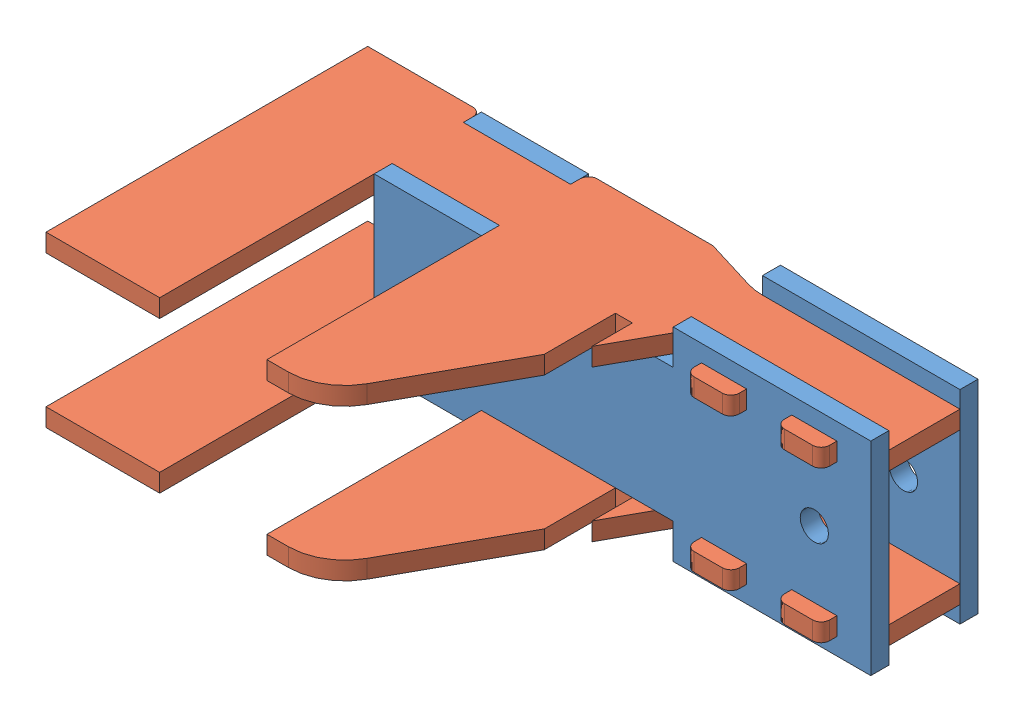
SolidWorks assembly Assemblage_encast.SLDASM, configuration Défaut (file format 12000). Lengths in mm.
Overall size (108.14 36 59.81).
4 component instances, 2 part files, 9 mates.
Components (placement in the parent):
- encas_base-1: encas_base.SLDPRT [Défaut] at origin size (88 36 3.2)
- encas_cote-2: encas_cote.SLDPRT [Défaut] at (-18.2397 15 15.8) x (-1 0 0) z (0 -1 0) size (108.14 59.81 3.2)
- encas_cote-4: encas_cote.SLDPRT [Défaut] at (-18.2397 -11.8 15.8) x (-1 0 0) z (0 -1 0) size (108.14 59.81 3.2)
- encas_base-3: encas_base.SLDPRT [Défaut] at (0 0 15.8) size (88 36 3.2)
Mates (geometry in assembly coordinates):
- Coïncidente4: coincident anti-aligned: plane of encas_base-1 through (4 15 3.2) normal (-1 0 0); plane of encas_cote-2 through (4 11.8 15.8) normal (1 0 0)
- Coïncidente5: coincident anti-aligned: plane of encas_base-1 through (4 11.8 3.2) normal (0 1 0); plane of encas_cote-2 through (-18.2397 11.8 15.8) normal (0 -1 0)
- Coïncidente6: coincident anti-aligned: plane of encas_base-1 through (0 0 3.2) normal (0 0 1); plane of encas_cote-2 through (-12 11.8 3.2) normal (0 0 -1)
- Coïncidente10: coincident anti-aligned: plane of encas_base-1 through (4 -11.8 3.2) normal (0 -1 0); plane of encas_cote-4 through (-18.2397 -11.8 15.8) normal (0 1 0)
- Coïncidente11: coincident anti-aligned: plane of encas_base-1 through (-20 -11.8 3.2) normal (1 0 0); plane of encas_cote-4 through (-20 -15 21.8) normal (-1 0 0)
- Coïncidente12: coincident anti-aligned: plane of encas_cote-4 through (-12 -15 3.2) normal (0 0 -1); plane of encas_base-1 through (0 0 3.2) normal (0 0 1)
- Coïncidente16: coincident anti-aligned: plane of encas_cote-4 through (-18.2397 -15 15.8) normal (0 -1 0); plane of encas_base-3 through (4 -15 19) normal (0 1 0)
- Coïncidente19: coincident anti-aligned: plane of encas_cote-4 through (-4 -15 21.8) normal (-1 0 0); plane of encas_base-3 through (-4 -15 19) normal (1 0 0)
- Coïncidente20: coincident anti-aligned: plane of encas_cote-4 through (-4 -15 15.8) normal (0 0 1); plane of encas_base-3 through (0 0 15.8) normal (0 0 -1)
